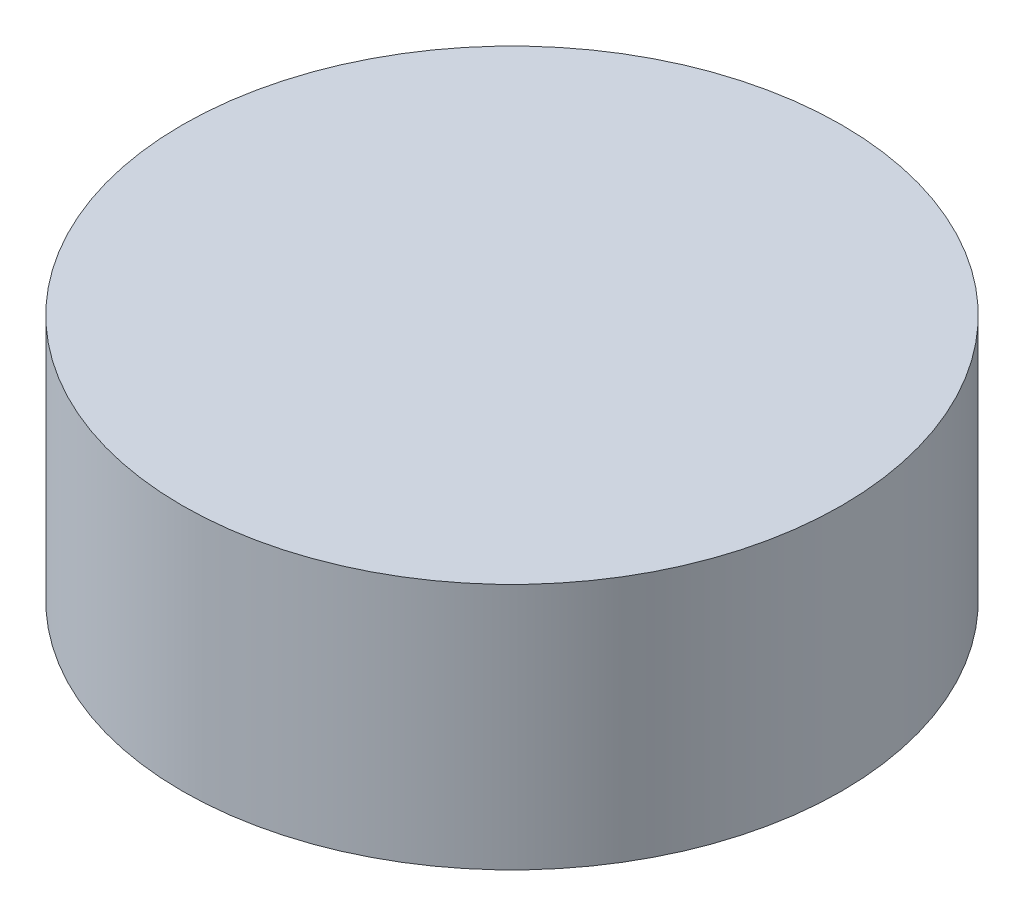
from build123d import *

# Parameters (mm, degrees)
SKETCH_1_R      = 4
EXTRUDE_1_DEPTH = 2
SKETCH_1_2_R    = 4
EXTRUDE_2_DEPTH = 3


with BuildPart() as part:
    # Sketch 1 → Extrude 1 (new body)
    with BuildSketch(Plane(origin=(0, 0, 0), x_dir=(1, 0, 0), z_dir=(0, 1, 0))):
        with Locations(Location((0, 0, 0), (0, 0, 270))):
            Circle(SKETCH_1_R)
    extrude(amount=EXTRUDE_1_DEPTH)

    # Sketch 1_2 → Extrude 2 (add)
    with BuildSketch(Plane(origin=(0, 0, 0), x_dir=(1, 0, 0), z_dir=(0, 1, 0))):
        with Locations(Location((0, 0, 0), (0, 0, 270))):
            Circle(SKETCH_1_2_R)
    extrude(amount=EXTRUDE_2_DEPTH)


solid = part.part
